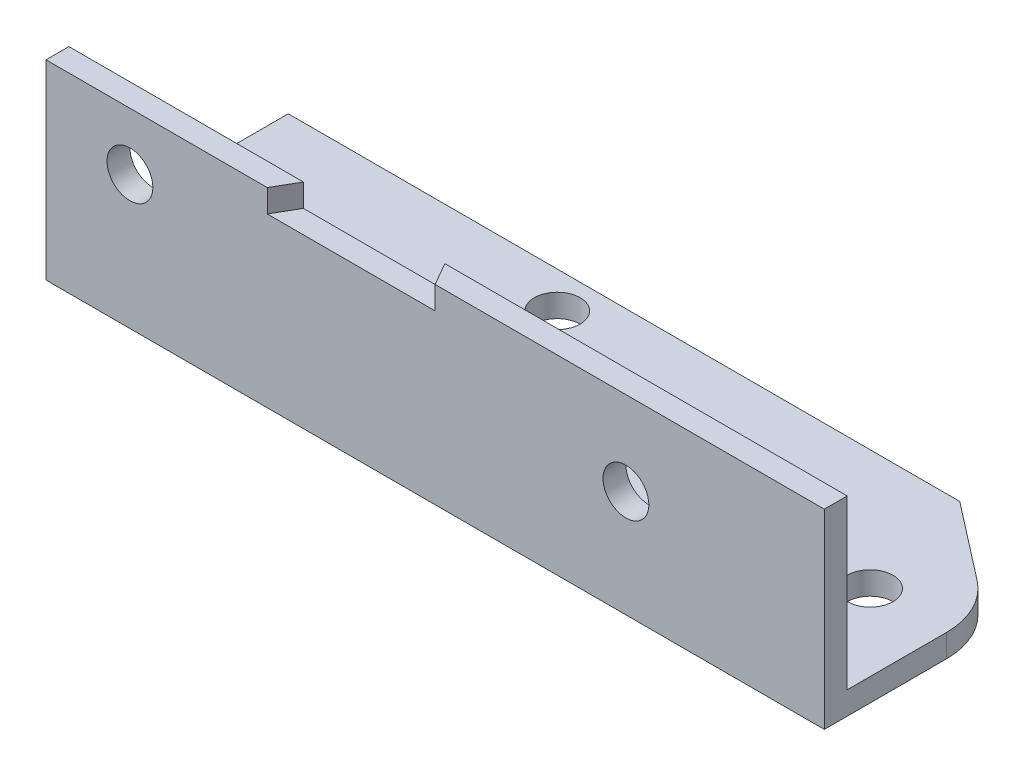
ISO-10303-21;
HEADER;
FILE_DESCRIPTION(('STEP AP214'),'2;1');
FILE_NAME('part.step','',(''),(''),'','','');
FILE_SCHEMA(('AUTOMOTIVE_DESIGN { 1 0 10303 214 1 1 1 1 }'));
ENDSEC;
DATA;
#1=APPLICATION_CONTEXT('core data for automotive mechanical design processes');
#2=APPLICATION_PROTOCOL_DEFINITION('international standard','automotive_design',2000,#1);
#3=PRODUCT_CONTEXT('',#1,'mechanical');
#4=PRODUCT('Part','Part','',(#3));
#5=PRODUCT_RELATED_PRODUCT_CATEGORY('part','',(#4));
#6=PRODUCT_DEFINITION_FORMATION('','',#4);
#7=PRODUCT_DEFINITION_CONTEXT('part definition',#1,'design');
#8=PRODUCT_DEFINITION('design','',#6,#7);
#9=PRODUCT_DEFINITION_SHAPE('','',#8);
#10=(LENGTH_UNIT() NAMED_UNIT(*) SI_UNIT(.MILLI.,.METRE.));
#11=(NAMED_UNIT(*) PLANE_ANGLE_UNIT() SI_UNIT($,.RADIAN.));
#12=(NAMED_UNIT(*) SI_UNIT($,.STERADIAN.) SOLID_ANGLE_UNIT());
#13=UNCERTAINTY_MEASURE_WITH_UNIT(LENGTH_MEASURE(1.E-05),#10,'distance_accuracy_value','');
#14=(GEOMETRIC_REPRESENTATION_CONTEXT(3) GLOBAL_UNCERTAINTY_ASSIGNED_CONTEXT((#13)) GLOBAL_UNIT_ASSIGNED_CONTEXT((#10,
#11,#12)) REPRESENTATION_CONTEXT('',''));
#15=CARTESIAN_POINT('',(0.,0.,0.));
#16=DIRECTION('',(0.,0.,1.));
#17=DIRECTION('',(1.,0.,0.));
#18=AXIS2_PLACEMENT_3D('',#15,#16,#17);
#19=CARTESIAN_POINT('',(0.,25.,-3.));
#20=DIRECTION('',(0.,-1.,0.));
#21=DIRECTION('',(0.,0.,-1.));
#22=AXIS2_PLACEMENT_3D('',#19,#20,#21);
#23=PLANE('',#22);
#24=DIRECTION('',(-1.,0.,0.));
#25=VECTOR('',#24,1.);
#26=CARTESIAN_POINT('',(0.,25.,-3.));
#27=LINE('',#26,#25);
#28=CARTESIAN_POINT('',(102.,25.,-3.00000000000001));
#29=VERTEX_POINT('',#28);
#30=CARTESIAN_POINT('',(49.2679491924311,25.,-3.00000000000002));
#31=VERTEX_POINT('',#30);
#32=EDGE_CURVE('E166',#29,#31,#27,.T.);
#33=ORIENTED_EDGE('',*,*,#32,.T.);
#34=DIRECTION('',(-0.500000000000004,0.,-0.866025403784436));
#35=VECTOR('',#34,1.);
#36=CARTESIAN_POINT('',(51.,25.,0.));
#37=LINE('',#36,#35);
#38=CARTESIAN_POINT('',(51.,25.,0.));
#39=VERTEX_POINT('',#38);
#40=EDGE_CURVE('E125',#39,#31,#37,.T.);
#41=ORIENTED_EDGE('',*,*,#40,.F.);
#42=DIRECTION('',(1.,0.,0.));
#43=VECTOR('',#42,1.);
#44=CARTESIAN_POINT('',(0.,25.,0.));
#45=LINE('',#44,#43);
#46=CARTESIAN_POINT('',(102.,25.,0.));
#47=VERTEX_POINT('',#46);
#48=EDGE_CURVE('E160',#39,#47,#45,.T.);
#49=ORIENTED_EDGE('',*,*,#48,.T.);
#50=DIRECTION('',(0.,0.,-1.));
#51=VECTOR('',#50,1.);
#52=CARTESIAN_POINT('',(102.,25.,0.));
#53=LINE('',#52,#51);
#54=EDGE_CURVE('E163',#47,#29,#53,.T.);
#55=ORIENTED_EDGE('',*,*,#54,.T.);
#56=EDGE_LOOP('',(#33,#41,#49,#55));
#57=FACE_BOUND('',#56,.T.);
#58=ADVANCED_FACE('F30',(#57),#23,.F.);
#59=CARTESIAN_POINT('',(92.,3.,-16.));
#60=DIRECTION('',(0.,1.,0.));
#61=DIRECTION('',(0.,0.,1.));
#62=AXIS2_PLACEMENT_3D('',#59,#60,#61);
#63=PLANE('',#62);
#64=DIRECTION('',(-1.,0.,0.));
#65=VECTOR('',#64,1.);
#66=CARTESIAN_POINT('',(0.,3.,-3.));
#67=LINE('',#66,#65);
#68=CARTESIAN_POINT('',(102.,3.,-3.00000000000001));
#69=VERTEX_POINT('',#68);
#70=CARTESIAN_POINT('',(0.,3.,-3.));
#71=VERTEX_POINT('',#70);
#72=EDGE_CURVE('E53',#69,#71,#67,.T.);
#73=ORIENTED_EDGE('',*,*,#72,.F.);
#74=DIRECTION('',(0.,0.,-1.));
#75=VECTOR('',#74,1.);
#76=CARTESIAN_POINT('',(102.,3.,0.));
#77=LINE('',#76,#75);
#78=CARTESIAN_POINT('',(102.,3.,-16.));
#79=VERTEX_POINT('',#78);
#80=EDGE_CURVE('E177',#69,#79,#77,.T.);
#81=ORIENTED_EDGE('',*,*,#80,.T.);
#82=CARTESIAN_POINT('',(92.,3.,-16.));
#83=DIRECTION('',(0.,1.,0.));
#84=DIRECTION('',(0.,0.,1.));
#85=AXIS2_PLACEMENT_3D('',#82,#83,#84);
#86=CIRCLE('',#85,10.);
#87=CARTESIAN_POINT('',(98.1249455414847,3.,-23.9047480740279));
#88=VERTEX_POINT('',#87);
#89=EDGE_CURVE('E209',#79,#88,#86,.T.);
#90=ORIENTED_EDGE('',*,*,#89,.T.);
#91=DIRECTION('',(-0.790474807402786,0.,-0.612494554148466));
#92=VECTOR('',#91,1.);
#93=CARTESIAN_POINT('',(88.,3.,-31.75));
#94=LINE('',#93,#92);
#95=CARTESIAN_POINT('',(88.,3.,-31.75));
#96=VERTEX_POINT('',#95);
#97=EDGE_CURVE('E211',#88,#96,#94,.T.);
#98=ORIENTED_EDGE('',*,*,#97,.T.);
#99=DIRECTION('',(-1.,0.,0.));
#100=VECTOR('',#99,1.);
#101=CARTESIAN_POINT('',(0.,3.,-31.75));
#102=LINE('',#101,#100);
#103=CARTESIAN_POINT('',(0.,3.,-31.75));
#104=VERTEX_POINT('',#103);
#105=EDGE_CURVE('E213',#96,#104,#102,.T.);
#106=ORIENTED_EDGE('',*,*,#105,.T.);
#107=DIRECTION('',(0.,0.,1.));
#108=VECTOR('',#107,1.);
#109=CARTESIAN_POINT('',(0.,3.,0.));
#110=LINE('',#109,#108);
#111=EDGE_CURVE('E200',#104,#71,#110,.T.);
#112=ORIENTED_EDGE('',*,*,#111,.T.);
#113=EDGE_LOOP('',(#73,#81,#90,#98,#106,#112));
#114=FACE_BOUND('',#113,.T.);
#115=CARTESIAN_POINT('',(92.,3.,-16.));
#116=DIRECTION('',(0.,1.,0.));
#117=DIRECTION('',(0.,0.,1.));
#118=AXIS2_PLACEMENT_3D('',#115,#116,#117);
#119=CIRCLE('',#118,2.99999999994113);
#120=CARTESIAN_POINT('',(92.,3.,-13.0000000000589));
#121=VERTEX_POINT('',#120);
#122=EDGE_CURVE('E219',#121,#121,#119,.T.);
#123=ORIENTED_EDGE('',*,*,#122,.F.);
#124=EDGE_LOOP('',(#123));
#125=FACE_BOUND('',#124,.T.);
#126=CARTESIAN_POINT('',(40.,3.,-27.));
#127=DIRECTION('',(0.,1.,0.));
#128=DIRECTION('',(0.,0.,1.));
#129=AXIS2_PLACEMENT_3D('',#126,#127,#128);
#130=CIRCLE('',#129,3.);
#131=CARTESIAN_POINT('',(40.,3.,-24.));
#132=VERTEX_POINT('',#131);
#133=EDGE_CURVE('E172',#132,#132,#130,.T.);
#134=ORIENTED_EDGE('',*,*,#133,.F.);
#135=EDGE_LOOP('',(#134));
#136=FACE_BOUND('',#135,.T.);
#137=ADVANCED_FACE('F259',(#114,#125,#136),#63,.T.);
#138=CARTESIAN_POINT('',(92.,0.,-16.));
#139=DIRECTION('',(0.,1.,0.));
#140=DIRECTION('',(0.,0.,1.));
#141=AXIS2_PLACEMENT_3D('',#138,#139,#140);
#142=PLANE('',#141);
#143=CARTESIAN_POINT('',(92.,0.,-16.));
#144=DIRECTION('',(0.,1.,0.));
#145=DIRECTION('',(0.,0.,1.));
#146=AXIS2_PLACEMENT_3D('',#143,#144,#145);
#147=CIRCLE('',#146,2.99999999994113);
#148=CARTESIAN_POINT('',(92.,0.,-13.0000000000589));
#149=VERTEX_POINT('',#148);
#150=EDGE_CURVE('E205',#149,#149,#147,.T.);
#151=ORIENTED_EDGE('',*,*,#150,.T.);
#152=EDGE_LOOP('',(#151));
#153=FACE_BOUND('',#152,.T.);
#154=DIRECTION('',(0.,0.,1.));
#155=VECTOR('',#154,1.);
#156=CARTESIAN_POINT('',(0.,0.,0.));
#157=LINE('',#156,#155);
#158=CARTESIAN_POINT('',(0.,0.,-31.75));
#159=VERTEX_POINT('',#158);
#160=CARTESIAN_POINT('',(0.,0.,0.));
#161=VERTEX_POINT('',#160);
#162=EDGE_CURVE('E216',#159,#161,#157,.T.);
#163=ORIENTED_EDGE('',*,*,#162,.F.);
#164=DIRECTION('',(-1.,0.,0.));
#165=VECTOR('',#164,1.);
#166=CARTESIAN_POINT('',(0.,0.,-31.75));
#167=LINE('',#166,#165);
#168=CARTESIAN_POINT('',(88.,0.,-31.75));
#169=VERTEX_POINT('',#168);
#170=EDGE_CURVE('E202',#169,#159,#167,.T.);
#171=ORIENTED_EDGE('',*,*,#170,.F.);
#172=DIRECTION('',(-0.790474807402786,0.,-0.612494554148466));
#173=VECTOR('',#172,1.);
#174=CARTESIAN_POINT('',(88.,0.,-31.75));
#175=LINE('',#174,#173);
#176=CARTESIAN_POINT('',(98.1249455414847,0.,-23.9047480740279));
#177=VERTEX_POINT('',#176);
#178=EDGE_CURVE('E225',#177,#169,#175,.T.);
#179=ORIENTED_EDGE('',*,*,#178,.F.);
#180=CARTESIAN_POINT('',(92.,0.,-16.));
#181=DIRECTION('',(0.,1.,0.));
#182=DIRECTION('',(0.,0.,1.));
#183=AXIS2_PLACEMENT_3D('',#180,#181,#182);
#184=CIRCLE('',#183,10.);
#185=CARTESIAN_POINT('',(102.,0.,-16.));
#186=VERTEX_POINT('',#185);
#187=EDGE_CURVE('E223',#186,#177,#184,.T.);
#188=ORIENTED_EDGE('',*,*,#187,.F.);
#189=DIRECTION('',(0.,0.,-1.));
#190=VECTOR('',#189,1.);
#191=CARTESIAN_POINT('',(102.,0.,0.));
#192=LINE('',#191,#190);
#193=CARTESIAN_POINT('',(102.,0.,0.));
#194=VERTEX_POINT('',#193);
#195=EDGE_CURVE('E221',#194,#186,#192,.T.);
#196=ORIENTED_EDGE('',*,*,#195,.F.);
#197=DIRECTION('',(1.,0.,0.));
#198=VECTOR('',#197,1.);
#199=CARTESIAN_POINT('',(0.,0.,0.));
#200=LINE('',#199,#198);
#201=EDGE_CURVE('E218',#161,#194,#200,.T.);
#202=ORIENTED_EDGE('',*,*,#201,.F.);
#203=EDGE_LOOP('',(#163,#171,#179,#188,#196,#202));
#204=FACE_BOUND('',#203,.T.);
#205=CARTESIAN_POINT('',(40.,0.,-27.));
#206=DIRECTION('',(0.,1.,0.));
#207=DIRECTION('',(0.,0.,1.));
#208=AXIS2_PLACEMENT_3D('',#205,#206,#207);
#209=CIRCLE('',#208,3.);
#210=CARTESIAN_POINT('',(40.,0.,-24.));
#211=VERTEX_POINT('',#210);
#212=EDGE_CURVE('E187',#211,#211,#209,.T.);
#213=ORIENTED_EDGE('',*,*,#212,.T.);
#214=EDGE_LOOP('',(#213));
#215=FACE_BOUND('',#214,.T.);
#216=ADVANCED_FACE('F247',(#153,#204,#215),#142,.F.);
#217=CARTESIAN_POINT('',(0.,3.,0.));
#218=DIRECTION('',(1.,0.,0.));
#219=DIRECTION('',(0.,0.,-1.));
#220=AXIS2_PLACEMENT_3D('',#217,#218,#219);
#221=PLANE('',#220);
#222=ORIENTED_EDGE('',*,*,#162,.T.);
#223=DIRECTION('',(0.,-1.,0.));
#224=VECTOR('',#223,1.);
#225=CARTESIAN_POINT('',(0.,3.,0.));
#226=LINE('',#225,#224);
#227=CARTESIAN_POINT('',(0.,25.,0.));
#228=VERTEX_POINT('',#227);
#229=EDGE_CURVE('E189',#228,#161,#226,.T.);
#230=ORIENTED_EDGE('',*,*,#229,.F.);
#231=DIRECTION('',(0.,0.,1.));
#232=VECTOR('',#231,1.);
#233=CARTESIAN_POINT('',(0.,25.,0.));
#234=LINE('',#233,#232);
#235=CARTESIAN_POINT('',(0.,25.,-3.));
#236=VERTEX_POINT('',#235);
#237=EDGE_CURVE('E157',#236,#228,#234,.T.);
#238=ORIENTED_EDGE('',*,*,#237,.F.);
#239=DIRECTION('',(0.,-1.,0.));
#240=VECTOR('',#239,1.);
#241=CARTESIAN_POINT('',(0.,25.,-3.));
#242=LINE('',#241,#240);
#243=EDGE_CURVE('E169',#236,#71,#242,.T.);
#244=ORIENTED_EDGE('',*,*,#243,.T.);
#245=ORIENTED_EDGE('',*,*,#111,.F.);
#246=DIRECTION('',(0.,-1.,0.));
#247=VECTOR('',#246,1.);
#248=CARTESIAN_POINT('',(0.,3.,-31.75));
#249=LINE('',#248,#247);
#250=EDGE_CURVE('E215',#104,#159,#249,.T.);
#251=ORIENTED_EDGE('',*,*,#250,.T.);
#252=EDGE_LOOP('',(#222,#230,#238,#244,#245,#251));
#253=FACE_BOUND('',#252,.T.);
#254=ADVANCED_FACE('F32',(#253),#221,.F.);
#255=CARTESIAN_POINT('',(0.,3.,0.));
#256=DIRECTION('',(0.,0.,-1.));
#257=DIRECTION('',(-1.,0.,0.));
#258=AXIS2_PLACEMENT_3D('',#255,#256,#257);
#259=PLANE('',#258);
#260=CARTESIAN_POINT('',(76.,14.,0.));
#261=DIRECTION('',(0.,0.,-1.));
#262=DIRECTION('',(-1.,0.,0.));
#263=AXIS2_PLACEMENT_3D('',#260,#261,#262);
#264=CIRCLE('',#263,3.00000000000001);
#265=CARTESIAN_POINT('',(73.,14.,0.));
#266=VERTEX_POINT('',#265);
#267=EDGE_CURVE('E145',#266,#266,#264,.T.);
#268=ORIENTED_EDGE('',*,*,#267,.T.);
#269=EDGE_LOOP('',(#268));
#270=FACE_BOUND('',#269,.T.);
#271=ORIENTED_EDGE('',*,*,#48,.F.);
#272=DIRECTION('',(0.,1.,0.));
#273=VECTOR('',#272,1.);
#274=CARTESIAN_POINT('',(51.,22.,0.));
#275=LINE('',#274,#273);
#276=CARTESIAN_POINT('',(51.,22.,0.));
#277=VERTEX_POINT('',#276);
#278=EDGE_CURVE('E133',#277,#39,#275,.T.);
#279=ORIENTED_EDGE('',*,*,#278,.F.);
#280=DIRECTION('',(1.,0.,0.));
#281=VECTOR('',#280,1.);
#282=CARTESIAN_POINT('',(29.,22.,0.));
#283=LINE('',#282,#281);
#284=CARTESIAN_POINT('',(29.,22.,0.));
#285=VERTEX_POINT('',#284);
#286=EDGE_CURVE('E122',#285,#277,#283,.T.);
#287=ORIENTED_EDGE('',*,*,#286,.F.);
#288=DIRECTION('',(0.,1.,0.));
#289=VECTOR('',#288,1.);
#290=CARTESIAN_POINT('',(29.,22.,0.));
#291=LINE('',#290,#289);
#292=CARTESIAN_POINT('',(29.,25.,0.));
#293=VERTEX_POINT('',#292);
#294=EDGE_CURVE('E128',#285,#293,#291,.T.);
#295=ORIENTED_EDGE('',*,*,#294,.T.);
#296=EDGE_CURVE('E161',#228,#293,#45,.T.);
#297=ORIENTED_EDGE('',*,*,#296,.F.);
#298=ORIENTED_EDGE('',*,*,#229,.T.);
#299=ORIENTED_EDGE('',*,*,#201,.T.);
#300=DIRECTION('',(0.,-1.,0.));
#301=VECTOR('',#300,1.);
#302=CARTESIAN_POINT('',(102.,3.,0.));
#303=LINE('',#302,#301);
#304=EDGE_CURVE('E193',#47,#194,#303,.T.);
#305=ORIENTED_EDGE('',*,*,#304,.F.);
#306=EDGE_LOOP('',(#271,#279,#287,#295,#297,#298,#299,#305));
#307=FACE_BOUND('',#306,.T.);
#308=CARTESIAN_POINT('',(11.,17.5,0.));
#309=DIRECTION('',(0.,0.,-1.));
#310=DIRECTION('',(-1.,0.,0.));
#311=AXIS2_PLACEMENT_3D('',#308,#309,#310);
#312=CIRCLE('',#311,3.);
#313=CARTESIAN_POINT('',(8.,17.5,0.));
#314=VERTEX_POINT('',#313);
#315=EDGE_CURVE('E152',#314,#314,#312,.T.);
#316=ORIENTED_EDGE('',*,*,#315,.T.);
#317=EDGE_LOOP('',(#316));
#318=FACE_BOUND('',#317,.T.);
#319=ADVANCED_FACE('F138',(#270,#307,#318),#259,.F.);
#320=CARTESIAN_POINT('',(102.,3.,0.));
#321=DIRECTION('',(-1.,0.,0.));
#322=DIRECTION('',(0.,0.,1.));
#323=AXIS2_PLACEMENT_3D('',#320,#321,#322);
#324=PLANE('',#323);
#325=ORIENTED_EDGE('',*,*,#195,.T.);
#326=DIRECTION('',(0.,-1.,0.));
#327=VECTOR('',#326,1.);
#328=CARTESIAN_POINT('',(102.,3.,-16.));
#329=LINE('',#328,#327);
#330=EDGE_CURVE('E197',#79,#186,#329,.T.);
#331=ORIENTED_EDGE('',*,*,#330,.F.);
#332=ORIENTED_EDGE('',*,*,#80,.F.);
#333=DIRECTION('',(0.,-1.,0.));
#334=VECTOR('',#333,1.);
#335=CARTESIAN_POINT('',(102.,25.,-3.00000000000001));
#336=LINE('',#335,#334);
#337=EDGE_CURVE('E182',#29,#69,#336,.T.);
#338=ORIENTED_EDGE('',*,*,#337,.F.);
#339=ORIENTED_EDGE('',*,*,#54,.F.);
#340=ORIENTED_EDGE('',*,*,#304,.T.);
#341=EDGE_LOOP('',(#325,#331,#332,#338,#339,#340));
#342=FACE_BOUND('',#341,.T.);
#343=ADVANCED_FACE('F262',(#342),#324,.F.);
#344=CARTESIAN_POINT('',(92.,3.,-16.));
#345=DIRECTION('',(0.,-1.,0.));
#346=DIRECTION('',(0.,0.,-1.));
#347=AXIS2_PLACEMENT_3D('',#344,#345,#346);
#348=CYLINDRICAL_SURFACE('',#347,10.);
#349=ORIENTED_EDGE('',*,*,#187,.T.);
#350=DIRECTION('',(0.,-1.,0.));
#351=VECTOR('',#350,1.);
#352=CARTESIAN_POINT('',(98.1249455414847,3.,-23.9047480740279));
#353=LINE('',#352,#351);
#354=EDGE_CURVE('E233',#88,#177,#353,.T.);
#355=ORIENTED_EDGE('',*,*,#354,.F.);
#356=ORIENTED_EDGE('',*,*,#89,.F.);
#357=ORIENTED_EDGE('',*,*,#330,.T.);
#358=EDGE_LOOP('',(#349,#355,#356,#357));
#359=FACE_BOUND('',#358,.T.);
#360=ADVANCED_FACE('F240',(#359),#348,.T.);
#361=CARTESIAN_POINT('',(88.,3.,-31.75));
#362=DIRECTION('',(-0.612494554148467,0.,0.790474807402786));
#363=DIRECTION('',(0.790474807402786,0.,0.612494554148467));
#364=AXIS2_PLACEMENT_3D('',#361,#362,#363);
#365=PLANE('',#364);
#366=ORIENTED_EDGE('',*,*,#178,.T.);
#367=DIRECTION('',(0.,-1.,0.));
#368=VECTOR('',#367,1.);
#369=CARTESIAN_POINT('',(88.,3.,-31.75));
#370=LINE('',#369,#368);
#371=EDGE_CURVE('E230',#96,#169,#370,.T.);
#372=ORIENTED_EDGE('',*,*,#371,.F.);
#373=ORIENTED_EDGE('',*,*,#97,.F.);
#374=ORIENTED_EDGE('',*,*,#354,.T.);
#375=EDGE_LOOP('',(#366,#372,#373,#374));
#376=FACE_BOUND('',#375,.T.);
#377=ADVANCED_FACE('F252',(#376),#365,.F.);
#378=CARTESIAN_POINT('',(0.,3.,-31.75));
#379=DIRECTION('',(0.,0.,1.));
#380=DIRECTION('',(1.,0.,0.));
#381=AXIS2_PLACEMENT_3D('',#378,#379,#380);
#382=PLANE('',#381);
#383=ORIENTED_EDGE('',*,*,#170,.T.);
#384=ORIENTED_EDGE('',*,*,#250,.F.);
#385=ORIENTED_EDGE('',*,*,#105,.F.);
#386=ORIENTED_EDGE('',*,*,#371,.T.);
#387=EDGE_LOOP('',(#383,#384,#385,#386));
#388=FACE_BOUND('',#387,.T.);
#389=ADVANCED_FACE('F256',(#388),#382,.F.);
#390=CARTESIAN_POINT('',(92.,3.,-16.));
#391=DIRECTION('',(0.,-1.,0.));
#392=DIRECTION('',(0.,0.,-1.));
#393=AXIS2_PLACEMENT_3D('',#390,#391,#392);
#394=CYLINDRICAL_SURFACE('',#393,2.99999999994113);
#395=ORIENTED_EDGE('',*,*,#122,.T.);
#396=EDGE_LOOP('',(#395));
#397=FACE_BOUND('',#396,.T.);
#398=ORIENTED_EDGE('',*,*,#150,.F.);
#399=EDGE_LOOP('',(#398));
#400=FACE_BOUND('',#399,.T.);
#401=ADVANCED_FACE('F297',(#397,#400),#394,.F.);
#402=CARTESIAN_POINT('',(40.,3.,-27.));
#403=DIRECTION('',(0.,-1.,0.));
#404=DIRECTION('',(0.,0.,-1.));
#405=AXIS2_PLACEMENT_3D('',#402,#403,#404);
#406=CYLINDRICAL_SURFACE('',#405,3.);
#407=ORIENTED_EDGE('',*,*,#133,.T.);
#408=EDGE_LOOP('',(#407));
#409=FACE_BOUND('',#408,.T.);
#410=ORIENTED_EDGE('',*,*,#212,.F.);
#411=EDGE_LOOP('',(#410));
#412=FACE_BOUND('',#411,.T.);
#413=ADVANCED_FACE('F283',(#409,#412),#406,.F.);
#414=CARTESIAN_POINT('',(0.,25.,-3.));
#415=DIRECTION('',(0.,0.,1.));
#416=DIRECTION('',(1.,0.,0.));
#417=AXIS2_PLACEMENT_3D('',#414,#415,#416);
#418=PLANE('',#417);
#419=CARTESIAN_POINT('',(76.,14.,-3.00000000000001));
#420=DIRECTION('',(0.,0.,-1.));
#421=DIRECTION('',(-1.,0.,0.));
#422=AXIS2_PLACEMENT_3D('',#419,#420,#421);
#423=CIRCLE('',#422,3.00000000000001);
#424=CARTESIAN_POINT('',(73.,14.,-3.00000000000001));
#425=VERTEX_POINT('',#424);
#426=EDGE_CURVE('E315',#425,#425,#423,.T.);
#427=ORIENTED_EDGE('',*,*,#426,.F.);
#428=EDGE_LOOP('',(#427));
#429=FACE_BOUND('',#428,.T.);
#430=CARTESIAN_POINT('',(11.,17.5,-3.));
#431=DIRECTION('',(0.,0.,-1.));
#432=DIRECTION('',(-1.,0.,0.));
#433=AXIS2_PLACEMENT_3D('',#430,#431,#432);
#434=CIRCLE('',#433,3.);
#435=CARTESIAN_POINT('',(8.,17.5,-3.));
#436=VERTEX_POINT('',#435);
#437=EDGE_CURVE('E151',#436,#436,#434,.T.);
#438=ORIENTED_EDGE('',*,*,#437,.F.);
#439=EDGE_LOOP('',(#438));
#440=FACE_BOUND('',#439,.T.);
#441=DIRECTION('',(-1.,0.,0.));
#442=VECTOR('',#441,1.);
#443=CARTESIAN_POINT('',(0.,22.,-3.));
#444=LINE('',#443,#442);
#445=CARTESIAN_POINT('',(49.2679491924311,22.,-3.00000000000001));
#446=VERTEX_POINT('',#445);
#447=CARTESIAN_POINT('',(30.7320508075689,22.,-3.));
#448=VERTEX_POINT('',#447);
#449=EDGE_CURVE('E11',#446,#448,#444,.T.);
#450=ORIENTED_EDGE('',*,*,#449,.F.);
#451=DIRECTION('',(0.,1.,0.));
#452=VECTOR('',#451,1.);
#453=CARTESIAN_POINT('',(49.2679491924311,25.,-3.00000000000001));
#454=LINE('',#453,#452);
#455=EDGE_CURVE('E148',#446,#31,#454,.T.);
#456=ORIENTED_EDGE('',*,*,#455,.T.);
#457=ORIENTED_EDGE('',*,*,#32,.F.);
#458=ORIENTED_EDGE('',*,*,#337,.T.);
#459=ORIENTED_EDGE('',*,*,#72,.T.);
#460=ORIENTED_EDGE('',*,*,#243,.F.);
#461=CARTESIAN_POINT('',(30.7320508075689,25.,-3.00000000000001));
#462=VERTEX_POINT('',#461);
#463=EDGE_CURVE('E165',#462,#236,#27,.T.);
#464=ORIENTED_EDGE('',*,*,#463,.F.);
#465=DIRECTION('',(0.,-1.,0.));
#466=VECTOR('',#465,1.);
#467=CARTESIAN_POINT('',(30.7320508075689,25.,-3.));
#468=LINE('',#467,#466);
#469=EDGE_CURVE('E45',#462,#448,#468,.T.);
#470=ORIENTED_EDGE('',*,*,#469,.T.);
#471=EDGE_LOOP('',(#450,#456,#457,#458,#459,#460,#464,#470));
#472=FACE_BOUND('',#471,.T.);
#473=ADVANCED_FACE('F266',(#429,#440,#472),#418,.F.);
#474=ORIENTED_EDGE('',*,*,#296,.T.);
#475=DIRECTION('',(0.500000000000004,0.,-0.866025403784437));
#476=VECTOR('',#475,1.);
#477=CARTESIAN_POINT('',(23.0490381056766,25.,10.3073683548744));
#478=LINE('',#477,#476);
#479=EDGE_CURVE('E38',#293,#462,#478,.T.);
#480=ORIENTED_EDGE('',*,*,#479,.T.);
#481=ORIENTED_EDGE('',*,*,#463,.T.);
#482=ORIENTED_EDGE('',*,*,#237,.T.);
#483=EDGE_LOOP('',(#474,#480,#481,#482));
#484=FACE_BOUND('',#483,.T.);
#485=ADVANCED_FACE('F273',(#484),#23,.F.);
#486=CARTESIAN_POINT('',(11.,17.5,0.));
#487=DIRECTION('',(0.,0.,-1.));
#488=DIRECTION('',(-1.,0.,0.));
#489=AXIS2_PLACEMENT_3D('',#486,#487,#488);
#490=CYLINDRICAL_SURFACE('',#489,3.);
#491=ORIENTED_EDGE('',*,*,#315,.F.);
#492=EDGE_LOOP('',(#491));
#493=FACE_BOUND('',#492,.T.);
#494=ORIENTED_EDGE('',*,*,#437,.T.);
#495=EDGE_LOOP('',(#494));
#496=FACE_BOUND('',#495,.T.);
#497=ADVANCED_FACE('F275',(#493,#496),#490,.F.);
#498=CARTESIAN_POINT('',(33.6188021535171,22.,-8.));
#499=DIRECTION('',(0.,1.,0.));
#500=DIRECTION('',(0.,0.,1.));
#501=AXIS2_PLACEMENT_3D('',#498,#499,#500);
#502=PLANE('',#501);
#503=ORIENTED_EDGE('',*,*,#449,.T.);
#504=DIRECTION('',(-0.500000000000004,0.,0.866025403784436));
#505=VECTOR('',#504,1.);
#506=CARTESIAN_POINT('',(29.,22.,0.));
#507=LINE('',#506,#505);
#508=EDGE_CURVE('E117',#448,#285,#507,.T.);
#509=ORIENTED_EDGE('',*,*,#508,.T.);
#510=ORIENTED_EDGE('',*,*,#286,.T.);
#511=DIRECTION('',(-0.500000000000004,0.,-0.866025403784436));
#512=VECTOR('',#511,1.);
#513=CARTESIAN_POINT('',(51.,22.,0.));
#514=LINE('',#513,#512);
#515=EDGE_CURVE('E134',#277,#446,#514,.T.);
#516=ORIENTED_EDGE('',*,*,#515,.T.);
#517=EDGE_LOOP('',(#503,#509,#510,#516));
#518=FACE_BOUND('',#517,.T.);
#519=ADVANCED_FACE('F119',(#518),#502,.T.);
#520=CARTESIAN_POINT('',(51.,22.,0.));
#521=DIRECTION('',(0.866025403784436,0.,-0.500000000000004));
#522=DIRECTION('',(-0.500000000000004,0.,-0.866025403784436));
#523=AXIS2_PLACEMENT_3D('',#520,#521,#522);
#524=PLANE('',#523);
#525=ORIENTED_EDGE('',*,*,#515,.F.);
#526=ORIENTED_EDGE('',*,*,#278,.T.);
#527=ORIENTED_EDGE('',*,*,#40,.T.);
#528=ORIENTED_EDGE('',*,*,#455,.F.);
#529=EDGE_LOOP('',(#525,#526,#527,#528));
#530=FACE_BOUND('',#529,.T.);
#531=ADVANCED_FACE('F329',(#530),#524,.F.);
#532=CARTESIAN_POINT('',(29.,22.,0.));
#533=DIRECTION('',(-0.866025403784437,0.,-0.500000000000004));
#534=DIRECTION('',(-0.500000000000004,0.,0.866025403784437));
#535=AXIS2_PLACEMENT_3D('',#532,#533,#534);
#536=PLANE('',#535);
#537=ORIENTED_EDGE('',*,*,#479,.F.);
#538=ORIENTED_EDGE('',*,*,#294,.F.);
#539=ORIENTED_EDGE('',*,*,#508,.F.);
#540=ORIENTED_EDGE('',*,*,#469,.F.);
#541=EDGE_LOOP('',(#537,#538,#539,#540));
#542=FACE_BOUND('',#541,.T.);
#543=ADVANCED_FACE('F129',(#542),#536,.F.);
#544=CARTESIAN_POINT('',(76.,14.,0.));
#545=DIRECTION('',(0.,0.,-1.));
#546=DIRECTION('',(-1.,0.,0.));
#547=AXIS2_PLACEMENT_3D('',#544,#545,#546);
#548=CYLINDRICAL_SURFACE('',#547,3.00000000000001);
#549=ORIENTED_EDGE('',*,*,#267,.F.);
#550=EDGE_LOOP('',(#549));
#551=FACE_BOUND('',#550,.T.);
#552=ORIENTED_EDGE('',*,*,#426,.T.);
#553=EDGE_LOOP('',(#552));
#554=FACE_BOUND('',#553,.T.);
#555=ADVANCED_FACE('F320',(#551,#554),#548,.F.);
#556=CLOSED_SHELL('',(#58,#137,#216,#254,#319,#343,#360,#377,#389,#401,#413,#473,#485,#497,#519,
#531,#543,#555));
#557=MANIFOLD_SOLID_BREP('B2',#556);
#558=ADVANCED_BREP_SHAPE_REPRESENTATION('',(#18,#557),#14);
#559=SHAPE_DEFINITION_REPRESENTATION(#9,#558);
ENDSEC;
END-ISO-10303-21;
